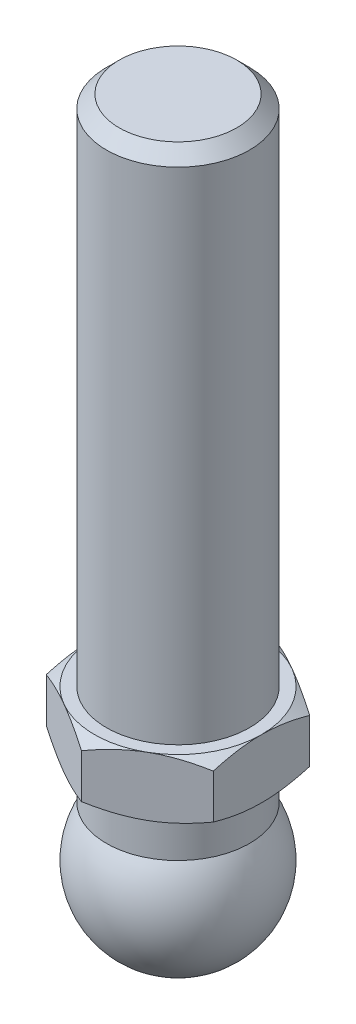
ISO-10303-21;
HEADER;
FILE_DESCRIPTION(('STEP AP214'),'2;1');
FILE_NAME('part.step','',(''),(''),'','','');
FILE_SCHEMA(('AUTOMOTIVE_DESIGN { 1 0 10303 214 1 1 1 1 }'));
ENDSEC;
DATA;
#1=APPLICATION_CONTEXT('core data for automotive mechanical design processes');
#2=APPLICATION_PROTOCOL_DEFINITION('international standard','automotive_design',2000,#1);
#3=PRODUCT_CONTEXT('',#1,'mechanical');
#4=PRODUCT('Part','Part','',(#3));
#5=PRODUCT_RELATED_PRODUCT_CATEGORY('part','',(#4));
#6=PRODUCT_DEFINITION_FORMATION('','',#4);
#7=PRODUCT_DEFINITION_CONTEXT('part definition',#1,'design');
#8=PRODUCT_DEFINITION('design','',#6,#7);
#9=PRODUCT_DEFINITION_SHAPE('','',#8);
#10=(LENGTH_UNIT() NAMED_UNIT(*) SI_UNIT(.MILLI.,.METRE.));
#11=(NAMED_UNIT(*) PLANE_ANGLE_UNIT() SI_UNIT($,.RADIAN.));
#12=(NAMED_UNIT(*) SI_UNIT($,.STERADIAN.) SOLID_ANGLE_UNIT());
#13=UNCERTAINTY_MEASURE_WITH_UNIT(LENGTH_MEASURE(1.E-05),#10,'distance_accuracy_value','');
#14=(GEOMETRIC_REPRESENTATION_CONTEXT(3) GLOBAL_UNCERTAINTY_ASSIGNED_CONTEXT((#13)) GLOBAL_UNIT_ASSIGNED_CONTEXT((#10,
#11,#12)) REPRESENTATION_CONTEXT('',''));
#15=CARTESIAN_POINT('',(0.,0.,0.));
#16=DIRECTION('',(0.,0.,1.));
#17=DIRECTION('',(1.,0.,0.));
#18=AXIS2_PLACEMENT_3D('',#15,#16,#17);
#19=CARTESIAN_POINT('',(0.,12.6,0.));
#20=DIRECTION('',(0.,-1.,0.));
#21=DIRECTION('',(0.,0.,-1.));
#22=AXIS2_PLACEMENT_3D('',#19,#20,#21);
#23=CONICAL_SURFACE('',#22,7.,1.0471975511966);
#24=CARTESIAN_POINT('',(-7.,8.53828268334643,12.1648696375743));
#25=CARTESIAN_POINT('',(-7.,8.68391573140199,11.8738003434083));
#26=CARTESIAN_POINT('',(-7.,8.82854589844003,11.5822239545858));
#27=CARTESIAN_POINT('',(-7.,9.11531569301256,10.997825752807));
#28=CARTESIAN_POINT('',(-7.,9.25745515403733,10.7050038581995));
#29=CARTESIAN_POINT('',(-7.,9.53902214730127,10.117331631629));
#30=CARTESIAN_POINT('',(-7.,9.67844364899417,9.8224784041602));
#31=CARTESIAN_POINT('',(-7.,9.95360604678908,9.23106328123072));
#32=CARTESIAN_POINT('',(-7.,10.0893470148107,8.93450141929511));
#33=CARTESIAN_POINT('',(-7.,10.3623110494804,8.32593520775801));
#34=CARTESIAN_POINT('',(-7.,10.4993254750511,8.0138369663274));
#35=CARTESIAN_POINT('',(-7.,10.7671383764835,7.38695797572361));
#36=CARTESIAN_POINT('',(-7.,10.8979365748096,7.07217710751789));
#37=CARTESIAN_POINT('',(-7.,11.1515530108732,6.43962449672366));
#38=CARTESIAN_POINT('',(-7.,11.274376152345,6.12185473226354));
#39=CARTESIAN_POINT('',(-7.,11.5099016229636,5.4826031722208));
#40=CARTESIAN_POINT('',(-7.,11.6226050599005,5.16112178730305));
#41=CARTESIAN_POINT('',(-7.,11.8599014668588,4.43821731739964));
#42=CARTESIAN_POINT('',(-7.,11.981118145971,4.03566892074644));
#43=CARTESIAN_POINT('',(-7.,12.1969740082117,3.22331060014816));
#44=CARTESIAN_POINT('',(-7.,12.2916155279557,2.81350131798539));
#45=CARTESIAN_POINT('',(-7.,12.4069999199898,2.1974256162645));
#46=CARTESIAN_POINT('',(-7.,12.4408518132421,1.99359214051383));
#47=CARTESIAN_POINT('',(-7.,12.4993191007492,1.58461613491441));
#48=CARTESIAN_POINT('',(-7.,12.5239358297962,1.37947379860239));
#49=CARTESIAN_POINT('',(-7.,12.5631968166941,0.968289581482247));
#50=CARTESIAN_POINT('',(-7.,12.5778439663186,0.762247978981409));
#51=CARTESIAN_POINT('',(-7.,12.5967021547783,0.349683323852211));
#52=CARTESIAN_POINT('',(-7.,12.6009132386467,0.143160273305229));
#53=CARTESIAN_POINT('',(-7.,12.5987493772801,-0.271082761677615));
#54=CARTESIAN_POINT('',(-7.,12.5923100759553,-0.47880240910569));
#55=CARTESIAN_POINT('',(-7.,12.5689433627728,-0.893645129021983));
#56=CARTESIAN_POINT('',(-7.,12.5520159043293,-1.10076819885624));
#57=CARTESIAN_POINT('',(-7.,12.5082124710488,-1.5140304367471));
#58=CARTESIAN_POINT('',(-7.,12.4813327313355,-1.72016920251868));
#59=CARTESIAN_POINT('',(-7.,12.4184180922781,-2.13103319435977));
#60=CARTESIAN_POINT('',(-7.,12.3823828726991,-2.33575837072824));
#61=CARTESIAN_POINT('',(-7.,12.2605686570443,-2.95437912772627));
#62=CARTESIAN_POINT('',(-7.,12.1618729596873,-3.36575077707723));
#63=CARTESIAN_POINT('',(-7.,11.9384533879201,-4.18138012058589));
#64=CARTESIAN_POINT('',(-7.,11.8137148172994,-4.58563365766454));
#65=CARTESIAN_POINT('',(-7.,11.5733248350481,-5.30320893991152));
#66=CARTESIAN_POINT('',(-7.,11.4612875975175,-5.6177595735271));
#67=CARTESIAN_POINT('',(-7.,11.2278514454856,-6.24325021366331));
#68=CARTESIAN_POINT('',(-7.,11.1064551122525,-6.55419118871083));
#69=CARTESIAN_POINT('',(-7.,10.8562070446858,-7.17328528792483));
#70=CARTESIAN_POINT('',(-7.,10.7273503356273,-7.48143638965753));
#71=CARTESIAN_POINT('',(-7.,10.4637823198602,-8.09523802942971));
#72=CARTESIAN_POINT('',(-7.,10.3290706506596,-8.40088841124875));
#73=CARTESIAN_POINT('',(-7.,10.0607840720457,-8.99716345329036));
#74=CARTESIAN_POINT('',(-7.,9.92740317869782,-9.2878756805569));
#75=CARTESIAN_POINT('',(-7.,9.65714715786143,-9.86766295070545));
#76=CARTESIAN_POINT('',(-7.,9.52027208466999,-10.1567380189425));
#77=CARTESIAN_POINT('',(-7.,9.24389786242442,-10.7329937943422));
#78=CARTESIAN_POINT('',(-7.,9.10440383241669,-11.0201769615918));
#79=CARTESIAN_POINT('',(-7.,8.82302286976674,-11.5933594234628));
#80=CARTESIAN_POINT('',(-7.,8.68113600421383,-11.879358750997));
#81=CARTESIAN_POINT('',(-7.,8.53828268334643,-12.1648696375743));
#82=B_SPLINE_CURVE_WITH_KNOTS('',3,(#24,#25,#26,#27,#28,#29,#30,#31,#32,#33,#34,#35,#36,#37,#38,
#39,#40,#41,#42,#43,#44,#45,#46,#47,#48,#49,#50,#51,#52,#53,#54,#55,#56,#57,#58,#59,#60,#61,#62,
#63,#64,#65,#66,#67,#68,#69,#70,#71,#72,#73,#74,#75,#76,#77,#78,#79,#80,#81),.UNSPECIFIED.,.F.,
.F.,(4,2,2,2,2,2,2,2,2,2,2,2,2,2,2,2,2,2,2,2,2,2,2,2,2,2,2,2,4),(0.,0.976413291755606,
1.95289161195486,2.93133423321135,3.90975772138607,4.93225217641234,5.95479223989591,
6.97669748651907,7.99849072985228,9.25906449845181,10.5195273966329,11.1392271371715,
11.7588372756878,12.3782676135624,12.9976952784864,13.6208795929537,14.2440666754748,
14.8674897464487,15.490934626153,16.7587972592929,18.027377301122,19.0289263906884,
20.0302002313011,21.0321496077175,22.0341611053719,22.9936838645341,23.9531917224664,
24.9109871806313,25.8687558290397),.UNSPECIFIED.);
#83=CARTESIAN_POINT('',(-7.,11.9747852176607,4.04145188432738));
#84=VERTEX_POINT('',#83);
#85=CARTESIAN_POINT('',(-7.,12.6,0.));
#86=VERTEX_POINT('',#85);
#87=EDGE_CURVE('E316',#84,#86,#82,.T.);
#88=ORIENTED_EDGE('',*,*,#87,.F.);
#89=CARTESIAN_POINT('',(0.0002,11.9747185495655,8.0830192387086));
#90=CARTESIAN_POINT('',(-0.153667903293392,12.0260001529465,7.99418356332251));
#91=CARTESIAN_POINT('',(-0.30810950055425,12.0749544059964,7.90501666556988));
#92=CARTESIAN_POINT('',(-0.618246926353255,12.1675672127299,7.72595873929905));
#93=CARTESIAN_POINT('',(-0.773943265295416,12.2112234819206,7.63606741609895));
#94=CARTESIAN_POINT('',(-1.24352516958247,12.3333884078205,7.36495417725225));
#95=CARTESIAN_POINT('',(-1.5592643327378,12.402874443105,7.18266208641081));
#96=CARTESIAN_POINT('',(-2.03176224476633,12.4843550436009,6.9098652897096));
#97=CARTESIAN_POINT('',(-2.18710922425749,12.5075665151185,6.82017566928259));
#98=CARTESIAN_POINT('',(-2.49850511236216,12.5464887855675,6.64039116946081));
#99=CARTESIAN_POINT('',(-2.65455395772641,12.5622002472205,6.55029632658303));
#100=CARTESIAN_POINT('',(-2.96692267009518,12.5857220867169,6.36995016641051));
#101=CARTESIAN_POINT('',(-3.12324202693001,12.5935414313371,6.27969914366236));
#102=CARTESIAN_POINT('',(-3.43601650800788,12.6011197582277,6.09911871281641));
#103=CARTESIAN_POINT('',(-3.59247162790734,12.600878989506,6.00878930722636));
#104=CARTESIAN_POINT('',(-4.02110687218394,12.5891402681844,5.76131663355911));
#105=CARTESIAN_POINT('',(-4.2931466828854,12.5694342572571,5.60425437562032));
#106=CARTESIAN_POINT('',(-4.8354194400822,12.5069465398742,5.29117305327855));
#107=CARTESIAN_POINT('',(-5.10565047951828,12.464143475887,5.13515508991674));
#108=CARTESIAN_POINT('',(-5.64901454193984,12.3571483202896,4.82144370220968));
#109=CARTESIAN_POINT('',(-5.92207900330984,12.2925029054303,4.66378986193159));
#110=CARTESIAN_POINT('',(-6.46413578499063,12.145783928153,4.35083323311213));
#111=CARTESIAN_POINT('',(-6.73313504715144,12.0637448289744,4.19552643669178));
#112=CARTESIAN_POINT('',(-7.0002,11.9747185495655,4.04133641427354));
#113=B_SPLINE_CURVE_WITH_KNOTS('',3,(#89,#90,#91,#92,#93,#94,#95,#96,#97,#98,#99,#100,#101,#102,
#103,#104,#105,#106,#107,#108,#109,#110,#111,#112),.UNSPECIFIED.,.F.,.F.,(4,2,2,2,2,2,2,2,2,2,2,
4),(0.,0.554727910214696,1.10969417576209,2.2219327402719,2.76443041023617,3.30688013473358,
3.8487128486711,4.3905288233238,5.33376515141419,6.27787517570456,7.2429241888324,
8.20607866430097),.UNSPECIFIED.);
#114=CARTESIAN_POINT('',(-3.5,12.6,6.06217782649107));
#115=VERTEX_POINT('',#114);
#116=EDGE_CURVE('E138',#115,#84,#113,.T.);
#117=ORIENTED_EDGE('',*,*,#116,.F.);
#118=CARTESIAN_POINT('',(0.,12.6,0.));
#119=DIRECTION('',(0.,-1.,0.));
#120=DIRECTION('',(0.,0.,-1.));
#121=AXIS2_PLACEMENT_3D('',#118,#119,#120);
#122=CIRCLE('',#121,7.);
#123=EDGE_CURVE('E286',#115,#86,#122,.T.);
#124=ORIENTED_EDGE('',*,*,#123,.T.);
#125=EDGE_LOOP('',(#88,#117,#124));
#126=FACE_BOUND('',#125,.T.);
#127=ADVANCED_FACE('F17',(#126),#23,.T.);
#128=CARTESIAN_POINT('',(-7.,11.9747852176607,-4.04145188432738));
#129=VERTEX_POINT('',#128);
#130=EDGE_CURVE('E196',#86,#129,#82,.T.);
#131=ORIENTED_EDGE('',*,*,#130,.F.);
#132=CARTESIAN_POINT('',(-3.5,12.6,-6.06217782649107));
#133=VERTEX_POINT('',#132);
#134=EDGE_CURVE('E198',#86,#133,#122,.T.);
#135=ORIENTED_EDGE('',*,*,#134,.T.);
#136=CARTESIAN_POINT('',(-7.0002,11.9747185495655,-4.04133641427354));
#137=CARTESIAN_POINT('',(-6.84633209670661,12.0260001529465,-4.13017208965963));
#138=CARTESIAN_POINT('',(-6.69189049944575,12.0749544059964,-4.21933898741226));
#139=CARTESIAN_POINT('',(-6.38175307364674,12.1675672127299,-4.39839691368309));
#140=CARTESIAN_POINT('',(-6.22605673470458,12.2112234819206,-4.48828823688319));
#141=CARTESIAN_POINT('',(-5.75647483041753,12.3333884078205,-4.75940147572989));
#142=CARTESIAN_POINT('',(-5.4407356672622,12.402874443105,-4.94169356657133));
#143=CARTESIAN_POINT('',(-4.96823775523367,12.4843550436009,-5.21449036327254));
#144=CARTESIAN_POINT('',(-4.81289077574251,12.5075665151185,-5.30417998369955));
#145=CARTESIAN_POINT('',(-4.50149488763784,12.5464887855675,-5.48396448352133));
#146=CARTESIAN_POINT('',(-4.34544604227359,12.5622002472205,-5.57405932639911));
#147=CARTESIAN_POINT('',(-4.03307732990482,12.5857220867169,-5.75440548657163));
#148=CARTESIAN_POINT('',(-3.87675797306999,12.5935414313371,-5.84465650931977));
#149=CARTESIAN_POINT('',(-3.56398349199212,12.6011197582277,-6.02523694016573));
#150=CARTESIAN_POINT('',(-3.40752837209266,12.600878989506,-6.11556634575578));
#151=CARTESIAN_POINT('',(-2.97889312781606,12.5891402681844,-6.36303901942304));
#152=CARTESIAN_POINT('',(-2.7068533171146,12.5694342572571,-6.52010127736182));
#153=CARTESIAN_POINT('',(-2.1645805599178,12.5069465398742,-6.83318259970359));
#154=CARTESIAN_POINT('',(-1.89434952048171,12.464143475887,-6.9892005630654));
#155=CARTESIAN_POINT('',(-1.35098545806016,12.3571483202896,-7.30291195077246));
#156=CARTESIAN_POINT('',(-1.07792099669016,12.2925029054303,-7.46056579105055));
#157=CARTESIAN_POINT('',(-0.535864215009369,12.145783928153,-7.77352241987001));
#158=CARTESIAN_POINT('',(-0.266864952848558,12.0637448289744,-7.92882921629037));
#159=CARTESIAN_POINT('',(0.000200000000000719,11.9747185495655,-8.0830192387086));
#160=B_SPLINE_CURVE_WITH_KNOTS('',3,(#136,#137,#138,#139,#140,#141,#142,#143,#144,#145,#146,
#147,#148,#149,#150,#151,#152,#153,#154,#155,#156,#157,#158,#159),.UNSPECIFIED.,.F.,.F.,(4,2,2,
2,2,2,2,2,2,2,2,4),(0.,0.554727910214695,1.10969417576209,2.2219327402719,2.76443041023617,
3.30688013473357,3.8487128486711,4.39052882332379,5.33376515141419,6.27787517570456,
7.2429241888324,8.20607866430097),.UNSPECIFIED.);
#161=EDGE_CURVE('E186',#129,#133,#160,.T.);
#162=ORIENTED_EDGE('',*,*,#161,.F.);
#163=EDGE_LOOP('',(#131,#135,#162));
#164=FACE_BOUND('',#163,.T.);
#165=ADVANCED_FACE('F195',(#164),#23,.T.);
#166=CARTESIAN_POINT('',(0.,11.9747852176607,-8.08290376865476));
#167=VERTEX_POINT('',#166);
#168=EDGE_CURVE('E200',#133,#167,#160,.T.);
#169=ORIENTED_EDGE('',*,*,#168,.F.);
#170=CARTESIAN_POINT('',(3.5,12.6,-6.06217782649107));
#171=VERTEX_POINT('',#170);
#172=EDGE_CURVE('E296',#133,#171,#122,.T.);
#173=ORIENTED_EDGE('',*,*,#172,.T.);
#174=CARTESIAN_POINT('',(-0.0002,11.9747185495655,-8.0830192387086));
#175=CARTESIAN_POINT('',(0.153667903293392,12.0260001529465,-7.99418356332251));
#176=CARTESIAN_POINT('',(0.30810950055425,12.0749544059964,-7.90501666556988));
#177=CARTESIAN_POINT('',(0.618246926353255,12.1675672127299,-7.72595873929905));
#178=CARTESIAN_POINT('',(0.773943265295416,12.2112234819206,-7.63606741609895));
#179=CARTESIAN_POINT('',(1.24352516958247,12.3333884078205,-7.36495417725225));
#180=CARTESIAN_POINT('',(1.5592643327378,12.402874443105,-7.18266208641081));
#181=CARTESIAN_POINT('',(2.03176224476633,12.4843550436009,-6.9098652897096));
#182=CARTESIAN_POINT('',(2.18710922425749,12.5075665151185,-6.82017566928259));
#183=CARTESIAN_POINT('',(2.49850511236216,12.5464887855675,-6.64039116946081));
#184=CARTESIAN_POINT('',(2.65455395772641,12.5622002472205,-6.55029632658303));
#185=CARTESIAN_POINT('',(2.96692267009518,12.5857220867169,-6.36995016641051));
#186=CARTESIAN_POINT('',(3.12324202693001,12.5935414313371,-6.27969914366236));
#187=CARTESIAN_POINT('',(3.43601650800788,12.6011197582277,-6.09911871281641));
#188=CARTESIAN_POINT('',(3.59247162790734,12.600878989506,-6.00878930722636));
#189=CARTESIAN_POINT('',(4.02110687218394,12.5891402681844,-5.76131663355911));
#190=CARTESIAN_POINT('',(4.2931466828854,12.5694342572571,-5.60425437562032));
#191=CARTESIAN_POINT('',(4.8354194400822,12.5069465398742,-5.29117305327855));
#192=CARTESIAN_POINT('',(5.10565047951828,12.464143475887,-5.13515508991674));
#193=CARTESIAN_POINT('',(5.64901454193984,12.3571483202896,-4.82144370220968));
#194=CARTESIAN_POINT('',(5.92207900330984,12.2925029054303,-4.66378986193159));
#195=CARTESIAN_POINT('',(6.46413578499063,12.145783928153,-4.35083323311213));
#196=CARTESIAN_POINT('',(6.73313504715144,12.0637448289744,-4.19552643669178));
#197=CARTESIAN_POINT('',(7.0002,11.9747185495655,-4.04133641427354));
#198=B_SPLINE_CURVE_WITH_KNOTS('',3,(#174,#175,#176,#177,#178,#179,#180,#181,#182,#183,#184,
#185,#186,#187,#188,#189,#190,#191,#192,#193,#194,#195,#196,#197),.UNSPECIFIED.,.F.,.F.,(4,2,2,
2,2,2,2,2,2,2,2,4),(0.,0.554727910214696,1.10969417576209,2.2219327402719,2.76443041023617,
3.30688013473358,3.8487128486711,4.3905288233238,5.33376515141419,6.27787517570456,
7.2429241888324,8.20607866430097),.UNSPECIFIED.);
#199=EDGE_CURVE('E246',#167,#171,#198,.T.);
#200=ORIENTED_EDGE('',*,*,#199,.F.);
#201=EDGE_LOOP('',(#169,#173,#200));
#202=FACE_BOUND('',#201,.T.);
#203=ADVANCED_FACE('F349',(#202),#23,.T.);
#204=CARTESIAN_POINT('',(7.,11.9747852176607,-4.04145188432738));
#205=VERTEX_POINT('',#204);
#206=EDGE_CURVE('E241',#171,#205,#198,.T.);
#207=ORIENTED_EDGE('',*,*,#206,.F.);
#208=CARTESIAN_POINT('',(7.,12.6,0.));
#209=VERTEX_POINT('',#208);
#210=EDGE_CURVE('E291',#171,#209,#122,.T.);
#211=ORIENTED_EDGE('',*,*,#210,.T.);
#212=CARTESIAN_POINT('',(7.,8.53828268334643,-12.1648696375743));
#213=CARTESIAN_POINT('',(7.,8.68391573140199,-11.8738003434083));
#214=CARTESIAN_POINT('',(7.,8.82854589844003,-11.5822239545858));
#215=CARTESIAN_POINT('',(7.,9.11531569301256,-10.997825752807));
#216=CARTESIAN_POINT('',(7.,9.25745515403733,-10.7050038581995));
#217=CARTESIAN_POINT('',(7.,9.53902214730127,-10.117331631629));
#218=CARTESIAN_POINT('',(7.,9.67844364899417,-9.8224784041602));
#219=CARTESIAN_POINT('',(7.,9.95360604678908,-9.23106328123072));
#220=CARTESIAN_POINT('',(7.,10.0893470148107,-8.93450141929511));
#221=CARTESIAN_POINT('',(7.,10.3623110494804,-8.32593520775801));
#222=CARTESIAN_POINT('',(7.,10.4993254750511,-8.0138369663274));
#223=CARTESIAN_POINT('',(7.,10.7671383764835,-7.38695797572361));
#224=CARTESIAN_POINT('',(7.,10.8979365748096,-7.07217710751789));
#225=CARTESIAN_POINT('',(7.,11.1515530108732,-6.43962449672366));
#226=CARTESIAN_POINT('',(7.,11.274376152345,-6.12185473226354));
#227=CARTESIAN_POINT('',(7.,11.5099016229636,-5.4826031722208));
#228=CARTESIAN_POINT('',(7.,11.6226050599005,-5.16112178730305));
#229=CARTESIAN_POINT('',(7.,11.8599014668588,-4.43821731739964));
#230=CARTESIAN_POINT('',(7.,11.981118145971,-4.03566892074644));
#231=CARTESIAN_POINT('',(7.,12.1969740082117,-3.22331060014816));
#232=CARTESIAN_POINT('',(7.,12.2916155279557,-2.81350131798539));
#233=CARTESIAN_POINT('',(7.,12.4069999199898,-2.1974256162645));
#234=CARTESIAN_POINT('',(7.,12.4408518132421,-1.99359214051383));
#235=CARTESIAN_POINT('',(7.,12.4993191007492,-1.58461613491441));
#236=CARTESIAN_POINT('',(7.,12.5239358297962,-1.37947379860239));
#237=CARTESIAN_POINT('',(7.,12.5631968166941,-0.968289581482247));
#238=CARTESIAN_POINT('',(7.,12.5778439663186,-0.762247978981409));
#239=CARTESIAN_POINT('',(7.,12.5967021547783,-0.349683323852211));
#240=CARTESIAN_POINT('',(7.,12.6009132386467,-0.143160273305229));
#241=CARTESIAN_POINT('',(7.,12.5987493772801,0.271082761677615));
#242=CARTESIAN_POINT('',(7.,12.5923100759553,0.47880240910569));
#243=CARTESIAN_POINT('',(7.,12.5689433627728,0.893645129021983));
#244=CARTESIAN_POINT('',(7.,12.5520159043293,1.10076819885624));
#245=CARTESIAN_POINT('',(7.,12.5082124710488,1.5140304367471));
#246=CARTESIAN_POINT('',(7.,12.4813327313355,1.72016920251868));
#247=CARTESIAN_POINT('',(7.,12.4184180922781,2.13103319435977));
#248=CARTESIAN_POINT('',(7.,12.3823828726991,2.33575837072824));
#249=CARTESIAN_POINT('',(7.,12.2605686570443,2.95437912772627));
#250=CARTESIAN_POINT('',(7.,12.1618729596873,3.36575077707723));
#251=CARTESIAN_POINT('',(7.,11.9384533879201,4.18138012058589));
#252=CARTESIAN_POINT('',(7.,11.8137148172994,4.58563365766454));
#253=CARTESIAN_POINT('',(7.,11.5733248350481,5.30320893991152));
#254=CARTESIAN_POINT('',(7.,11.4612875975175,5.6177595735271));
#255=CARTESIAN_POINT('',(7.,11.2278514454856,6.24325021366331));
#256=CARTESIAN_POINT('',(7.,11.1064551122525,6.55419118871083));
#257=CARTESIAN_POINT('',(7.,10.8562070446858,7.17328528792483));
#258=CARTESIAN_POINT('',(7.,10.7273503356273,7.48143638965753));
#259=CARTESIAN_POINT('',(7.,10.4637823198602,8.09523802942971));
#260=CARTESIAN_POINT('',(7.,10.3290706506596,8.40088841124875));
#261=CARTESIAN_POINT('',(7.,10.0607840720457,8.99716345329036));
#262=CARTESIAN_POINT('',(7.,9.92740317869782,9.2878756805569));
#263=CARTESIAN_POINT('',(7.,9.65714715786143,9.86766295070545));
#264=CARTESIAN_POINT('',(7.,9.52027208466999,10.1567380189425));
#265=CARTESIAN_POINT('',(7.,9.24389786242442,10.7329937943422));
#266=CARTESIAN_POINT('',(7.,9.10440383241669,11.0201769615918));
#267=CARTESIAN_POINT('',(7.,8.82302286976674,11.5933594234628));
#268=CARTESIAN_POINT('',(7.,8.68113600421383,11.879358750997));
#269=CARTESIAN_POINT('',(7.,8.53828268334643,12.1648696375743));
#270=B_SPLINE_CURVE_WITH_KNOTS('',3,(#212,#213,#214,#215,#216,#217,#218,#219,#220,#221,#222,
#223,#224,#225,#226,#227,#228,#229,#230,#231,#232,#233,#234,#235,#236,#237,#238,#239,#240,#241,
#242,#243,#244,#245,#246,#247,#248,#249,#250,#251,#252,#253,#254,#255,#256,#257,#258,#259,#260,
#261,#262,#263,#264,#265,#266,#267,#268,#269),.UNSPECIFIED.,.F.,.F.,(4,2,2,2,2,2,2,2,2,2,2,2,2,
2,2,2,2,2,2,2,2,2,2,2,2,2,2,2,4),(0.,0.976413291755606,1.95289161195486,2.93133423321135,
3.90975772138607,4.93225217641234,5.95479223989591,6.97669748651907,7.99849072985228,
9.25906449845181,10.5195273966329,11.1392271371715,11.7588372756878,12.3782676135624,
12.9976952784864,13.6208795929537,14.2440666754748,14.8674897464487,15.490934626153,
16.7587972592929,18.027377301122,19.0289263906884,20.0302002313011,21.0321496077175,
22.0341611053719,22.9936838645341,23.9531917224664,24.9109871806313,25.8687558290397),.UNSPECIFIED.);
#271=EDGE_CURVE('E252',#205,#209,#270,.T.);
#272=ORIENTED_EDGE('',*,*,#271,.F.);
#273=EDGE_LOOP('',(#207,#211,#272));
#274=FACE_BOUND('',#273,.T.);
#275=ADVANCED_FACE('F359',(#274),#23,.T.);
#276=CARTESIAN_POINT('',(7.,11.9747852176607,4.04145188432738));
#277=VERTEX_POINT('',#276);
#278=EDGE_CURVE('E254',#209,#277,#270,.T.);
#279=ORIENTED_EDGE('',*,*,#278,.F.);
#280=CARTESIAN_POINT('',(3.5,12.6,6.06217782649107));
#281=VERTEX_POINT('',#280);
#282=EDGE_CURVE('E284',#209,#281,#122,.T.);
#283=ORIENTED_EDGE('',*,*,#282,.T.);
#284=CARTESIAN_POINT('',(7.0002,11.9747185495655,4.04133641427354));
#285=CARTESIAN_POINT('',(6.84633209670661,12.0260001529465,4.13017208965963));
#286=CARTESIAN_POINT('',(6.69189049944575,12.0749544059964,4.21933898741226));
#287=CARTESIAN_POINT('',(6.38175307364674,12.1675672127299,4.39839691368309));
#288=CARTESIAN_POINT('',(6.22605673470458,12.2112234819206,4.48828823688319));
#289=CARTESIAN_POINT('',(5.75647483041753,12.3333884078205,4.75940147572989));
#290=CARTESIAN_POINT('',(5.4407356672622,12.402874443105,4.94169356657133));
#291=CARTESIAN_POINT('',(4.96823775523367,12.4843550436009,5.21449036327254));
#292=CARTESIAN_POINT('',(4.81289077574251,12.5075665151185,5.30417998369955));
#293=CARTESIAN_POINT('',(4.50149488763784,12.5464887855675,5.48396448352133));
#294=CARTESIAN_POINT('',(4.34544604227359,12.5622002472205,5.57405932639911));
#295=CARTESIAN_POINT('',(4.03307732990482,12.5857220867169,5.75440548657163));
#296=CARTESIAN_POINT('',(3.87675797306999,12.5935414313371,5.84465650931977));
#297=CARTESIAN_POINT('',(3.56398349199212,12.6011197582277,6.02523694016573));
#298=CARTESIAN_POINT('',(3.40752837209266,12.600878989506,6.11556634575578));
#299=CARTESIAN_POINT('',(2.97889312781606,12.5891402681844,6.36303901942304));
#300=CARTESIAN_POINT('',(2.7068533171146,12.5694342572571,6.52010127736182));
#301=CARTESIAN_POINT('',(2.1645805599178,12.5069465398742,6.83318259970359));
#302=CARTESIAN_POINT('',(1.89434952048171,12.464143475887,6.9892005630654));
#303=CARTESIAN_POINT('',(1.35098545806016,12.3571483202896,7.30291195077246));
#304=CARTESIAN_POINT('',(1.07792099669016,12.2925029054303,7.46056579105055));
#305=CARTESIAN_POINT('',(0.535864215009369,12.145783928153,7.77352241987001));
#306=CARTESIAN_POINT('',(0.266864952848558,12.0637448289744,7.92882921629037));
#307=CARTESIAN_POINT('',(-0.000200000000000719,11.9747185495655,8.0830192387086));
#308=B_SPLINE_CURVE_WITH_KNOTS('',3,(#284,#285,#286,#287,#288,#289,#290,#291,#292,#293,#294,
#295,#296,#297,#298,#299,#300,#301,#302,#303,#304,#305,#306,#307),.UNSPECIFIED.,.F.,.F.,(4,2,2,
2,2,2,2,2,2,2,2,4),(0.,0.554727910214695,1.10969417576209,2.2219327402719,2.76443041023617,
3.30688013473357,3.8487128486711,4.39052882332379,5.33376515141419,6.27787517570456,
7.2429241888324,8.20607866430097),.UNSPECIFIED.);
#309=EDGE_CURVE('E129',#277,#281,#308,.T.);
#310=ORIENTED_EDGE('',*,*,#309,.F.);
#311=EDGE_LOOP('',(#279,#283,#310));
#312=FACE_BOUND('',#311,.T.);
#313=ADVANCED_FACE('F288',(#312),#23,.T.);
#314=CARTESIAN_POINT('',(0.,11.9747852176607,8.08290376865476));
#315=VERTEX_POINT('',#314);
#316=EDGE_CURVE('E119',#281,#315,#308,.T.);
#317=ORIENTED_EDGE('',*,*,#316,.F.);
#318=EDGE_CURVE('E277',#281,#115,#122,.T.);
#319=ORIENTED_EDGE('',*,*,#318,.T.);
#320=EDGE_CURVE('E32',#315,#115,#113,.T.);
#321=ORIENTED_EDGE('',*,*,#320,.F.);
#322=EDGE_LOOP('',(#317,#319,#321));
#323=FACE_BOUND('',#322,.T.);
#324=ADVANCED_FACE('F276',(#323),#23,.T.);
#325=CARTESIAN_POINT('',(0.,55.6,0.));
#326=DIRECTION('',(0.,-1.,0.));
#327=DIRECTION('',(0.,0.,-1.));
#328=AXIS2_PLACEMENT_3D('',#325,#326,#327);
#329=PLANE('',#328);
#330=CARTESIAN_POINT('',(0.,55.6,0.));
#331=DIRECTION('',(0.,-1.,0.));
#332=DIRECTION('',(0.,0.,-1.));
#333=AXIS2_PLACEMENT_3D('',#330,#331,#332);
#334=CIRCLE('',#333,4.9265);
#335=CARTESIAN_POINT('',(0.,55.6,-4.9265));
#336=VERTEX_POINT('',#335);
#337=EDGE_CURVE('E25',#336,#336,#334,.T.);
#338=ORIENTED_EDGE('',*,*,#337,.F.);
#339=EDGE_LOOP('',(#338));
#340=FACE_BOUND('',#339,.T.);
#341=ADVANCED_FACE('F19',(#340),#329,.F.);
#342=CARTESIAN_POINT('',(0.,55.6,0.));
#343=DIRECTION('',(0.,-1.,0.));
#344=DIRECTION('',(0.,0.,-1.));
#345=AXIS2_PLACEMENT_3D('',#342,#343,#344);
#346=CONICAL_SURFACE('',#345,4.9265,0.785398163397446);
#347=CARTESIAN_POINT('',(0.,54.5265,0.));
#348=DIRECTION('',(0.,-1.,0.));
#349=DIRECTION('',(0.,0.,-1.));
#350=AXIS2_PLACEMENT_3D('',#347,#348,#349);
#351=CIRCLE('',#350,6.);
#352=CARTESIAN_POINT('',(0.,54.5265,-6.));
#353=VERTEX_POINT('',#352);
#354=EDGE_CURVE('E293',#353,#353,#351,.T.);
#355=ORIENTED_EDGE('',*,*,#354,.F.);
#356=EDGE_LOOP('',(#355));
#357=FACE_BOUND('',#356,.T.);
#358=ORIENTED_EDGE('',*,*,#337,.T.);
#359=EDGE_LOOP('',(#358));
#360=FACE_BOUND('',#359,.T.);
#361=ADVANCED_FACE('F357',(#357,#360),#346,.T.);
#362=CARTESIAN_POINT('',(0.,-7.,0.));
#363=DIRECTION('',(0.,-1.,0.));
#364=DIRECTION('',(0.,0.,-1.));
#365=AXIS2_PLACEMENT_3D('',#362,#363,#364);
#366=CYLINDRICAL_SURFACE('',#365,6.);
#367=CARTESIAN_POINT('',(0.,12.6,0.));
#368=DIRECTION('',(0.,-1.,0.));
#369=DIRECTION('',(0.,0.,-1.));
#370=AXIS2_PLACEMENT_3D('',#367,#368,#369);
#371=CIRCLE('',#370,6.);
#372=CARTESIAN_POINT('',(0.,12.6,-6.));
#373=VERTEX_POINT('',#372);
#374=EDGE_CURVE('E290',#373,#373,#371,.T.);
#375=ORIENTED_EDGE('',*,*,#374,.F.);
#376=EDGE_LOOP('',(#375));
#377=FACE_BOUND('',#376,.T.);
#378=ORIENTED_EDGE('',*,*,#354,.T.);
#379=EDGE_LOOP('',(#378));
#380=FACE_BOUND('',#379,.T.);
#381=ADVANCED_FACE('F442',(#377,#380),#366,.T.);
#382=CARTESIAN_POINT('',(6.,12.6,0.));
#383=DIRECTION('',(0.,-1.,0.));
#384=DIRECTION('',(0.,0.,-1.));
#385=AXIS2_PLACEMENT_3D('',#382,#383,#384);
#386=PLANE('',#385);
#387=ORIENTED_EDGE('',*,*,#282,.F.);
#388=ORIENTED_EDGE('',*,*,#210,.F.);
#389=ORIENTED_EDGE('',*,*,#172,.F.);
#390=ORIENTED_EDGE('',*,*,#134,.F.);
#391=ORIENTED_EDGE('',*,*,#123,.F.);
#392=ORIENTED_EDGE('',*,*,#318,.F.);
#393=EDGE_LOOP('',(#387,#388,#389,#390,#391,#392));
#394=FACE_BOUND('',#393,.T.);
#395=ORIENTED_EDGE('',*,*,#374,.T.);
#396=EDGE_LOOP('',(#395));
#397=FACE_BOUND('',#396,.T.);
#398=ADVANCED_FACE('F281',(#394,#397),#386,.F.);
#399=CARTESIAN_POINT('',(-7.,7.65,-4.04145188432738));
#400=DIRECTION('',(-1.,0.,0.));
#401=DIRECTION('',(0.,0.,1.));
#402=AXIS2_PLACEMENT_3D('',#399,#400,#401);
#403=PLANE('',#402);
#404=ORIENTED_EDGE('',*,*,#87,.T.);
#405=ORIENTED_EDGE('',*,*,#130,.T.);
#406=DIRECTION('',(0.,1.,0.));
#407=VECTOR('',#406,1.);
#408=CARTESIAN_POINT('',(-7.,7.65,-4.04145188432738));
#409=LINE('',#408,#407);
#410=CARTESIAN_POINT('',(-7.,8.27521478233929,-4.04145188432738));
#411=VERTEX_POINT('',#410);
#412=EDGE_CURVE('E112',#411,#129,#409,.T.);
#413=ORIENTED_EDGE('',*,*,#412,.F.);
#414=CARTESIAN_POINT('',(-7.,11.7117173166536,-12.1648696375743));
#415=CARTESIAN_POINT('',(-7.,11.566084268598,-11.8738003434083));
#416=CARTESIAN_POINT('',(-7.,11.42145410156,-11.5822239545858));
#417=CARTESIAN_POINT('',(-7.,11.1346843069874,-10.997825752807));
#418=CARTESIAN_POINT('',(-7.,10.9925448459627,-10.7050038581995));
#419=CARTESIAN_POINT('',(-7.,10.7109778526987,-10.1173316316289));
#420=CARTESIAN_POINT('',(-7.,10.5715563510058,-9.82247840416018));
#421=CARTESIAN_POINT('',(-7.,10.2963939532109,-9.2310632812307));
#422=CARTESIAN_POINT('',(-7.,10.1606529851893,-8.93450141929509));
#423=CARTESIAN_POINT('',(-7.,9.88768895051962,-8.32593520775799));
#424=CARTESIAN_POINT('',(-7.,9.75067452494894,-8.01383696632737));
#425=CARTESIAN_POINT('',(-7.,9.48286162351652,-7.38695797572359));
#426=CARTESIAN_POINT('',(-7.,9.3520634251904,-7.07217710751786));
#427=CARTESIAN_POINT('',(-7.,9.09844698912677,-6.43962449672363));
#428=CARTESIAN_POINT('',(-7.,8.97562384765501,-6.12185473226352));
#429=CARTESIAN_POINT('',(-7.,8.7400983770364,-5.48260317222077));
#430=CARTESIAN_POINT('',(-7.,8.62739494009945,-5.16112178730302));
#431=CARTESIAN_POINT('',(-7.,8.39009853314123,-4.43821731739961));
#432=CARTESIAN_POINT('',(-7.,8.26888185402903,-4.0356689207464));
#433=CARTESIAN_POINT('',(-7.,8.05302599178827,-3.22331060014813));
#434=CARTESIAN_POINT('',(-7.,7.95838447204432,-2.81350131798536));
#435=CARTESIAN_POINT('',(-7.,7.84300008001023,-2.19742561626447));
#436=CARTESIAN_POINT('',(-7.,7.80914818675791,-1.9935921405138));
#437=CARTESIAN_POINT('',(-7.,7.75068089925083,-1.58461613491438));
#438=CARTESIAN_POINT('',(-7.,7.7260641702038,-1.37947379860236));
#439=CARTESIAN_POINT('',(-7.,7.68680318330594,-0.968289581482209));
#440=CARTESIAN_POINT('',(-7.,7.67215603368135,-0.762247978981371));
#441=CARTESIAN_POINT('',(-7.,7.65329784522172,-0.349683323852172));
#442=CARTESIAN_POINT('',(-7.,7.64908676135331,-0.14316027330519));
#443=CARTESIAN_POINT('',(-7.,7.65125062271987,0.271082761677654));
#444=CARTESIAN_POINT('',(-7.,7.65768992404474,0.478802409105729));
#445=CARTESIAN_POINT('',(-7.,7.68105663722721,0.893645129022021));
#446=CARTESIAN_POINT('',(-7.,7.69798409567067,1.10076819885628));
#447=CARTESIAN_POINT('',(-7.,7.74178752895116,1.51403043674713));
#448=CARTESIAN_POINT('',(-7.,7.76866726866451,1.72016920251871));
#449=CARTESIAN_POINT('',(-7.,7.83158190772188,2.13103319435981));
#450=CARTESIAN_POINT('',(-7.,7.86761712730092,2.33575837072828));
#451=CARTESIAN_POINT('',(-7.,7.98943134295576,2.95437912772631));
#452=CARTESIAN_POINT('',(-7.,8.08812704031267,3.36575077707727));
#453=CARTESIAN_POINT('',(-7.,8.31154661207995,4.18138012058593));
#454=CARTESIAN_POINT('',(-7.,8.43628518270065,4.58563365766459));
#455=CARTESIAN_POINT('',(-7.,8.67667516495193,5.30320893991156));
#456=CARTESIAN_POINT('',(-7.,8.78871240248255,5.61775957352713));
#457=CARTESIAN_POINT('',(-7.,9.02214855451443,6.24325021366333));
#458=CARTESIAN_POINT('',(-7.,9.14354488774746,6.55419118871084));
#459=CARTESIAN_POINT('',(-7.,9.39379295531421,7.17328528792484));
#460=CARTESIAN_POINT('',(-7.,9.52264966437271,7.48143638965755));
#461=CARTESIAN_POINT('',(-7.,9.78621768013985,8.09523802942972));
#462=CARTESIAN_POINT('',(-7.,9.92092934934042,8.40088841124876));
#463=CARTESIAN_POINT('',(-7.,10.1892159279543,8.99716345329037));
#464=CARTESIAN_POINT('',(-7.,10.3225968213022,9.28787568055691));
#465=CARTESIAN_POINT('',(-7.,10.5928528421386,9.86766295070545));
#466=CARTESIAN_POINT('',(-7.,10.72972791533,10.1567380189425));
#467=CARTESIAN_POINT('',(-7.,11.0061021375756,10.7329937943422));
#468=CARTESIAN_POINT('',(-7.,11.1455961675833,11.0201769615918));
#469=CARTESIAN_POINT('',(-7.,11.4269771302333,11.5933594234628));
#470=CARTESIAN_POINT('',(-7.,11.5688639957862,11.879358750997));
#471=CARTESIAN_POINT('',(-7.,11.7117173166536,12.1648696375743));
#472=B_SPLINE_CURVE_WITH_KNOTS('',3,(#414,#415,#416,#417,#418,#419,#420,#421,#422,#423,#424,
#425,#426,#427,#428,#429,#430,#431,#432,#433,#434,#435,#436,#437,#438,#439,#440,#441,#442,#443,
#444,#445,#446,#447,#448,#449,#450,#451,#452,#453,#454,#455,#456,#457,#458,#459,#460,#461,#462,
#463,#464,#465,#466,#467,#468,#469,#470,#471),.UNSPECIFIED.,.F.,.F.,(4,2,2,2,2,2,2,2,2,2,2,2,2,
2,2,2,2,2,2,2,2,2,2,2,2,2,2,2,4),(0.,0.976413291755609,1.95289161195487,2.93133423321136,
3.90975772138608,4.93225217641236,5.95479223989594,6.9766974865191,7.99849072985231,
9.25906449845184,10.5195273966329,11.1392271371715,11.7588372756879,12.3782676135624,
12.9976952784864,13.6208795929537,14.2440666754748,14.8674897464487,15.490934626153,
16.758797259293,18.027377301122,19.0289263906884,20.0302002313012,21.0321496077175,
22.0341611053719,22.9936838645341,23.9531917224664,24.9109871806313,25.8687558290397),.UNSPECIFIED.);
#473=CARTESIAN_POINT('',(-7.,7.65,0.));
#474=VERTEX_POINT('',#473);
#475=EDGE_CURVE('E202',#411,#474,#472,.T.);
#476=ORIENTED_EDGE('',*,*,#475,.T.);
#477=CARTESIAN_POINT('',(-7.,8.27521478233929,4.04145188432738));
#478=VERTEX_POINT('',#477);
#479=EDGE_CURVE('E199',#474,#478,#472,.T.);
#480=ORIENTED_EDGE('',*,*,#479,.T.);
#481=DIRECTION('',(0.,1.,0.));
#482=VECTOR('',#481,1.);
#483=CARTESIAN_POINT('',(-7.,7.65,4.04145188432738));
#484=LINE('',#483,#482);
#485=EDGE_CURVE('E121',#478,#84,#484,.T.);
#486=ORIENTED_EDGE('',*,*,#485,.T.);
#487=EDGE_LOOP('',(#404,#405,#413,#476,#480,#486));
#488=FACE_BOUND('',#487,.T.);
#489=ADVANCED_FACE('F227',(#488),#403,.T.);
#490=CARTESIAN_POINT('',(0.,7.65,-8.08290376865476));
#491=DIRECTION('',(-0.5,0.,-0.866025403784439));
#492=DIRECTION('',(-0.866025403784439,0.,0.5));
#493=AXIS2_PLACEMENT_3D('',#490,#491,#492);
#494=PLANE('',#493);
#495=ORIENTED_EDGE('',*,*,#161,.T.);
#496=ORIENTED_EDGE('',*,*,#168,.T.);
#497=DIRECTION('',(0.,1.,0.));
#498=VECTOR('',#497,1.);
#499=CARTESIAN_POINT('',(0.,7.65,-8.08290376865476));
#500=LINE('',#499,#498);
#501=CARTESIAN_POINT('',(0.,8.27521478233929,-8.08290376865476));
#502=VERTEX_POINT('',#501);
#503=EDGE_CURVE('E178',#502,#167,#500,.T.);
#504=ORIENTED_EDGE('',*,*,#503,.F.);
#505=CARTESIAN_POINT('',(0.0002,8.2752814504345,-8.0830192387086));
#506=CARTESIAN_POINT('',(-0.153667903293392,8.22399984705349,-7.99418356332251));
#507=CARTESIAN_POINT('',(-0.30810950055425,8.17504559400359,-7.90501666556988));
#508=CARTESIAN_POINT('',(-0.618246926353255,8.08243278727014,-7.72595873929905));
#509=CARTESIAN_POINT('',(-0.773943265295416,8.03877651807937,-7.63606741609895));
#510=CARTESIAN_POINT('',(-1.24352516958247,7.9166115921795,-7.36495417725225));
#511=CARTESIAN_POINT('',(-1.5592643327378,7.84712555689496,-7.18266208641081));
#512=CARTESIAN_POINT('',(-2.03176224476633,7.7656449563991,-6.9098652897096));
#513=CARTESIAN_POINT('',(-2.18710922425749,7.74243348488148,-6.82017566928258));
#514=CARTESIAN_POINT('',(-2.49850511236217,7.70351121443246,-6.64039116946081));
#515=CARTESIAN_POINT('',(-2.65455395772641,7.68779975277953,-6.55029632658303));
#516=CARTESIAN_POINT('',(-2.96692267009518,7.66427791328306,-6.36995016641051));
#517=CARTESIAN_POINT('',(-3.12324202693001,7.65645856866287,-6.27969914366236));
#518=CARTESIAN_POINT('',(-3.43601650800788,7.64888024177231,-6.09911871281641));
#519=CARTESIAN_POINT('',(-3.59247162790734,7.64912101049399,-6.00878930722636));
#520=CARTESIAN_POINT('',(-4.02110687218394,7.6608597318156,-5.76131663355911));
#521=CARTESIAN_POINT('',(-4.2931466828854,7.68056574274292,-5.60425437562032));
#522=CARTESIAN_POINT('',(-4.8354194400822,7.74305346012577,-5.29117305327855));
#523=CARTESIAN_POINT('',(-5.10565047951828,7.78585652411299,-5.13515508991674));
#524=CARTESIAN_POINT('',(-5.64901454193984,7.89285167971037,-4.82144370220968));
#525=CARTESIAN_POINT('',(-5.92207900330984,7.95749709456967,-4.66378986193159));
#526=CARTESIAN_POINT('',(-6.46413578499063,8.10421607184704,-4.35083323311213));
#527=CARTESIAN_POINT('',(-6.73313504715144,8.18625517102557,-4.19552643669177));
#528=CARTESIAN_POINT('',(-7.0002,8.2752814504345,-4.04133641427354));
#529=B_SPLINE_CURVE_WITH_KNOTS('',3,(#505,#506,#507,#508,#509,#510,#511,#512,#513,#514,#515,
#516,#517,#518,#519,#520,#521,#522,#523,#524,#525,#526,#527,#528),.UNSPECIFIED.,.F.,.F.,(4,2,2,
2,2,2,2,2,2,2,2,4),(0.,0.554727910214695,1.10969417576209,2.2219327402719,2.76443041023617,
3.30688013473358,3.8487128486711,4.39052882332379,5.33376515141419,6.27787517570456,
7.2429241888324,8.20607866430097),.UNSPECIFIED.);
#530=CARTESIAN_POINT('',(-3.5,7.65,-6.06217782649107));
#531=VERTEX_POINT('',#530);
#532=EDGE_CURVE('E204',#502,#531,#529,.T.);
#533=ORIENTED_EDGE('',*,*,#532,.T.);
#534=EDGE_CURVE('E189',#531,#411,#529,.T.);
#535=ORIENTED_EDGE('',*,*,#534,.T.);
#536=ORIENTED_EDGE('',*,*,#412,.T.);
#537=EDGE_LOOP('',(#495,#496,#504,#533,#535,#536));
#538=FACE_BOUND('',#537,.T.);
#539=ADVANCED_FACE('F185',(#538),#494,.T.);
#540=CARTESIAN_POINT('',(7.,7.65,-4.04145188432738));
#541=DIRECTION('',(0.5,0.,-0.866025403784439));
#542=DIRECTION('',(-0.866025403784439,0.,-0.5));
#543=AXIS2_PLACEMENT_3D('',#540,#541,#542);
#544=PLANE('',#543);
#545=ORIENTED_EDGE('',*,*,#199,.T.);
#546=ORIENTED_EDGE('',*,*,#206,.T.);
#547=DIRECTION('',(0.,1.,0.));
#548=VECTOR('',#547,1.);
#549=CARTESIAN_POINT('',(7.,7.65,-4.04145188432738));
#550=LINE('',#549,#548);
#551=CARTESIAN_POINT('',(7.,8.27521478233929,-4.04145188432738));
#552=VERTEX_POINT('',#551);
#553=EDGE_CURVE('E175',#552,#205,#550,.T.);
#554=ORIENTED_EDGE('',*,*,#553,.F.);
#555=CARTESIAN_POINT('',(7.0002,8.2752814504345,-4.04133641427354));
#556=CARTESIAN_POINT('',(6.84633209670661,8.22399984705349,-4.13017208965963));
#557=CARTESIAN_POINT('',(6.69189049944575,8.17504559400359,-4.21933898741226));
#558=CARTESIAN_POINT('',(6.38175307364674,8.08243278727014,-4.39839691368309));
#559=CARTESIAN_POINT('',(6.22605673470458,8.03877651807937,-4.48828823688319));
#560=CARTESIAN_POINT('',(5.75647483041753,7.9166115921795,-4.75940147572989));
#561=CARTESIAN_POINT('',(5.4407356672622,7.84712555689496,-4.94169356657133));
#562=CARTESIAN_POINT('',(4.96823775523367,7.7656449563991,-5.21449036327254));
#563=CARTESIAN_POINT('',(4.81289077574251,7.74243348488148,-5.30417998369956));
#564=CARTESIAN_POINT('',(4.50149488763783,7.70351121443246,-5.48396448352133));
#565=CARTESIAN_POINT('',(4.34544604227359,7.68779975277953,-5.57405932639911));
#566=CARTESIAN_POINT('',(4.03307732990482,7.66427791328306,-5.75440548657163));
#567=CARTESIAN_POINT('',(3.87675797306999,7.65645856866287,-5.84465650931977));
#568=CARTESIAN_POINT('',(3.56398349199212,7.64888024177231,-6.02523694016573));
#569=CARTESIAN_POINT('',(3.40752837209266,7.64912101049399,-6.11556634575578));
#570=CARTESIAN_POINT('',(2.97889312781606,7.6608597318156,-6.36303901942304));
#571=CARTESIAN_POINT('',(2.7068533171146,7.68056574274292,-6.52010127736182));
#572=CARTESIAN_POINT('',(2.1645805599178,7.74305346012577,-6.83318259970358));
#573=CARTESIAN_POINT('',(1.89434952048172,7.78585652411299,-6.9892005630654));
#574=CARTESIAN_POINT('',(1.35098545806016,7.89285167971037,-7.30291195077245));
#575=CARTESIAN_POINT('',(1.07792099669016,7.95749709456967,-7.46056579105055));
#576=CARTESIAN_POINT('',(0.53586421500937,8.10421607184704,-7.77352241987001));
#577=CARTESIAN_POINT('',(0.266864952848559,8.18625517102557,-7.92882921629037));
#578=CARTESIAN_POINT('',(-0.000199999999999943,8.2752814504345,-8.0830192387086));
#579=B_SPLINE_CURVE_WITH_KNOTS('',3,(#555,#556,#557,#558,#559,#560,#561,#562,#563,#564,#565,
#566,#567,#568,#569,#570,#571,#572,#573,#574,#575,#576,#577,#578),.UNSPECIFIED.,.F.,.F.,(4,2,2,
2,2,2,2,2,2,2,2,4),(0.,0.554727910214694,1.10969417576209,2.2219327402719,2.76443041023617,
3.30688013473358,3.8487128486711,4.39052882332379,5.33376515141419,6.27787517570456,
7.2429241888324,8.20607866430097),.UNSPECIFIED.);
#580=CARTESIAN_POINT('',(3.5,7.65,-6.06217782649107));
#581=VERTEX_POINT('',#580);
#582=EDGE_CURVE('E247',#552,#581,#579,.T.);
#583=ORIENTED_EDGE('',*,*,#582,.T.);
#584=EDGE_CURVE('E235',#581,#502,#579,.T.);
#585=ORIENTED_EDGE('',*,*,#584,.T.);
#586=ORIENTED_EDGE('',*,*,#503,.T.);
#587=EDGE_LOOP('',(#545,#546,#554,#583,#585,#586));
#588=FACE_BOUND('',#587,.T.);
#589=ADVANCED_FACE('F226',(#588),#544,.T.);
#590=CARTESIAN_POINT('',(7.,7.65,4.04145188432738));
#591=DIRECTION('',(1.,0.,0.));
#592=DIRECTION('',(0.,0.,-1.));
#593=AXIS2_PLACEMENT_3D('',#590,#591,#592);
#594=PLANE('',#593);
#595=ORIENTED_EDGE('',*,*,#271,.T.);
#596=ORIENTED_EDGE('',*,*,#278,.T.);
#597=DIRECTION('',(0.,1.,0.));
#598=VECTOR('',#597,1.);
#599=CARTESIAN_POINT('',(7.,7.65,4.04145188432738));
#600=LINE('',#599,#598);
#601=CARTESIAN_POINT('',(7.,8.27521478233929,4.04145188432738));
#602=VERTEX_POINT('',#601);
#603=EDGE_CURVE('E120',#602,#277,#600,.T.);
#604=ORIENTED_EDGE('',*,*,#603,.F.);
#605=CARTESIAN_POINT('',(7.,11.7117173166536,12.1648696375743));
#606=CARTESIAN_POINT('',(7.,11.566084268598,11.8738003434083));
#607=CARTESIAN_POINT('',(7.,11.42145410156,11.5822239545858));
#608=CARTESIAN_POINT('',(7.,11.1346843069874,10.997825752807));
#609=CARTESIAN_POINT('',(7.,10.9925448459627,10.7050038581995));
#610=CARTESIAN_POINT('',(7.,10.7109778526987,10.1173316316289));
#611=CARTESIAN_POINT('',(7.,10.5715563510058,9.82247840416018));
#612=CARTESIAN_POINT('',(7.,10.2963939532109,9.2310632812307));
#613=CARTESIAN_POINT('',(7.,10.1606529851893,8.93450141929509));
#614=CARTESIAN_POINT('',(7.,9.88768895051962,8.32593520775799));
#615=CARTESIAN_POINT('',(7.,9.75067452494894,8.01383696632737));
#616=CARTESIAN_POINT('',(7.,9.48286162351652,7.38695797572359));
#617=CARTESIAN_POINT('',(7.,9.3520634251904,7.07217710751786));
#618=CARTESIAN_POINT('',(7.,9.09844698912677,6.43962449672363));
#619=CARTESIAN_POINT('',(7.,8.97562384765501,6.12185473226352));
#620=CARTESIAN_POINT('',(7.,8.7400983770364,5.48260317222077));
#621=CARTESIAN_POINT('',(7.,8.62739494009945,5.16112178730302));
#622=CARTESIAN_POINT('',(7.,8.39009853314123,4.43821731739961));
#623=CARTESIAN_POINT('',(7.,8.26888185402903,4.0356689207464));
#624=CARTESIAN_POINT('',(7.,8.05302599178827,3.22331060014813));
#625=CARTESIAN_POINT('',(7.,7.95838447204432,2.81350131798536));
#626=CARTESIAN_POINT('',(7.,7.84300008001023,2.19742561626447));
#627=CARTESIAN_POINT('',(7.,7.80914818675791,1.9935921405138));
#628=CARTESIAN_POINT('',(7.,7.75068089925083,1.58461613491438));
#629=CARTESIAN_POINT('',(7.,7.7260641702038,1.37947379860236));
#630=CARTESIAN_POINT('',(7.,7.68680318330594,0.968289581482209));
#631=CARTESIAN_POINT('',(7.,7.67215603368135,0.762247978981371));
#632=CARTESIAN_POINT('',(7.,7.65329784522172,0.349683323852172));
#633=CARTESIAN_POINT('',(7.,7.64908676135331,0.14316027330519));
#634=CARTESIAN_POINT('',(7.,7.65125062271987,-0.271082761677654));
#635=CARTESIAN_POINT('',(7.,7.65768992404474,-0.478802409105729));
#636=CARTESIAN_POINT('',(7.,7.68105663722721,-0.893645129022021));
#637=CARTESIAN_POINT('',(7.,7.69798409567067,-1.10076819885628));
#638=CARTESIAN_POINT('',(7.,7.74178752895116,-1.51403043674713));
#639=CARTESIAN_POINT('',(7.,7.76866726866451,-1.72016920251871));
#640=CARTESIAN_POINT('',(7.,7.83158190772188,-2.13103319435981));
#641=CARTESIAN_POINT('',(7.,7.86761712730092,-2.33575837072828));
#642=CARTESIAN_POINT('',(7.,7.98943134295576,-2.95437912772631));
#643=CARTESIAN_POINT('',(7.,8.08812704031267,-3.36575077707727));
#644=CARTESIAN_POINT('',(7.,8.31154661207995,-4.18138012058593));
#645=CARTESIAN_POINT('',(7.,8.43628518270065,-4.58563365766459));
#646=CARTESIAN_POINT('',(7.,8.67667516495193,-5.30320893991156));
#647=CARTESIAN_POINT('',(7.,8.78871240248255,-5.61775957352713));
#648=CARTESIAN_POINT('',(7.,9.02214855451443,-6.24325021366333));
#649=CARTESIAN_POINT('',(7.,9.14354488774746,-6.55419118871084));
#650=CARTESIAN_POINT('',(7.,9.39379295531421,-7.17328528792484));
#651=CARTESIAN_POINT('',(7.,9.52264966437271,-7.48143638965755));
#652=CARTESIAN_POINT('',(7.,9.78621768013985,-8.09523802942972));
#653=CARTESIAN_POINT('',(7.,9.92092934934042,-8.40088841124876));
#654=CARTESIAN_POINT('',(7.,10.1892159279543,-8.99716345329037));
#655=CARTESIAN_POINT('',(7.,10.3225968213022,-9.28787568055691));
#656=CARTESIAN_POINT('',(7.,10.5928528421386,-9.86766295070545));
#657=CARTESIAN_POINT('',(7.,10.72972791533,-10.1567380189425));
#658=CARTESIAN_POINT('',(7.,11.0061021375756,-10.7329937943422));
#659=CARTESIAN_POINT('',(7.,11.1455961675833,-11.0201769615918));
#660=CARTESIAN_POINT('',(7.,11.4269771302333,-11.5933594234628));
#661=CARTESIAN_POINT('',(7.,11.5688639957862,-11.879358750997));
#662=CARTESIAN_POINT('',(7.,11.7117173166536,-12.1648696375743));
#663=B_SPLINE_CURVE_WITH_KNOTS('',3,(#605,#606,#607,#608,#609,#610,#611,#612,#613,#614,#615,
#616,#617,#618,#619,#620,#621,#622,#623,#624,#625,#626,#627,#628,#629,#630,#631,#632,#633,#634,
#635,#636,#637,#638,#639,#640,#641,#642,#643,#644,#645,#646,#647,#648,#649,#650,#651,#652,#653,
#654,#655,#656,#657,#658,#659,#660,#661,#662),.UNSPECIFIED.,.F.,.F.,(4,2,2,2,2,2,2,2,2,2,2,2,2,
2,2,2,2,2,2,2,2,2,2,2,2,2,2,2,4),(0.,0.976413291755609,1.95289161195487,2.93133423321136,
3.90975772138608,4.93225217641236,5.95479223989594,6.9766974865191,7.99849072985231,
9.25906449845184,10.5195273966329,11.1392271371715,11.7588372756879,12.3782676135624,
12.9976952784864,13.6208795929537,14.2440666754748,14.8674897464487,15.490934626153,
16.758797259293,18.027377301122,19.0289263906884,20.0302002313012,21.0321496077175,
22.0341611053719,22.9936838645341,23.9531917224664,24.9109871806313,25.8687558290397),.UNSPECIFIED.);
#664=CARTESIAN_POINT('',(7.,7.65,0.));
#665=VERTEX_POINT('',#664);
#666=EDGE_CURVE('E258',#602,#665,#663,.T.);
#667=ORIENTED_EDGE('',*,*,#666,.T.);
#668=EDGE_CURVE('E263',#665,#552,#663,.T.);
#669=ORIENTED_EDGE('',*,*,#668,.T.);
#670=ORIENTED_EDGE('',*,*,#553,.T.);
#671=EDGE_LOOP('',(#595,#596,#604,#667,#669,#670));
#672=FACE_BOUND('',#671,.T.);
#673=ADVANCED_FACE('F156',(#672),#594,.T.);
#674=CARTESIAN_POINT('',(0.,7.65,8.08290376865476));
#675=DIRECTION('',(0.5,0.,0.866025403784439));
#676=DIRECTION('',(0.866025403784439,0.,-0.5));
#677=AXIS2_PLACEMENT_3D('',#674,#675,#676);
#678=PLANE('',#677);
#679=ORIENTED_EDGE('',*,*,#309,.T.);
#680=ORIENTED_EDGE('',*,*,#316,.T.);
#681=DIRECTION('',(0.,1.,0.));
#682=VECTOR('',#681,1.);
#683=CARTESIAN_POINT('',(0.,7.65,8.08290376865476));
#684=LINE('',#683,#682);
#685=CARTESIAN_POINT('',(0.,8.27521478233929,8.08290376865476));
#686=VERTEX_POINT('',#685);
#687=EDGE_CURVE('E107',#686,#315,#684,.T.);
#688=ORIENTED_EDGE('',*,*,#687,.F.);
#689=CARTESIAN_POINT('',(-0.0002,8.2752814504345,8.0830192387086));
#690=CARTESIAN_POINT('',(0.153667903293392,8.22399984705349,7.99418356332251));
#691=CARTESIAN_POINT('',(0.30810950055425,8.17504559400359,7.90501666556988));
#692=CARTESIAN_POINT('',(0.618246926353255,8.08243278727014,7.72595873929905));
#693=CARTESIAN_POINT('',(0.773943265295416,8.03877651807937,7.63606741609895));
#694=CARTESIAN_POINT('',(1.24352516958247,7.9166115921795,7.36495417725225));
#695=CARTESIAN_POINT('',(1.5592643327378,7.84712555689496,7.18266208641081));
#696=CARTESIAN_POINT('',(2.03176224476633,7.7656449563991,6.9098652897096));
#697=CARTESIAN_POINT('',(2.18710922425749,7.74243348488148,6.82017566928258));
#698=CARTESIAN_POINT('',(2.49850511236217,7.70351121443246,6.64039116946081));
#699=CARTESIAN_POINT('',(2.65455395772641,7.68779975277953,6.55029632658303));
#700=CARTESIAN_POINT('',(2.96692267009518,7.66427791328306,6.36995016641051));
#701=CARTESIAN_POINT('',(3.12324202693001,7.65645856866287,6.27969914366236));
#702=CARTESIAN_POINT('',(3.43601650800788,7.64888024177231,6.09911871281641));
#703=CARTESIAN_POINT('',(3.59247162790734,7.64912101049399,6.00878930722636));
#704=CARTESIAN_POINT('',(4.02110687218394,7.6608597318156,5.76131663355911));
#705=CARTESIAN_POINT('',(4.2931466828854,7.68056574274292,5.60425437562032));
#706=CARTESIAN_POINT('',(4.8354194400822,7.74305346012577,5.29117305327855));
#707=CARTESIAN_POINT('',(5.10565047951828,7.78585652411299,5.13515508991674));
#708=CARTESIAN_POINT('',(5.64901454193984,7.89285167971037,4.82144370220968));
#709=CARTESIAN_POINT('',(5.92207900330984,7.95749709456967,4.66378986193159));
#710=CARTESIAN_POINT('',(6.46413578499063,8.10421607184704,4.35083323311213));
#711=CARTESIAN_POINT('',(6.73313504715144,8.18625517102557,4.19552643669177));
#712=CARTESIAN_POINT('',(7.0002,8.2752814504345,4.04133641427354));
#713=B_SPLINE_CURVE_WITH_KNOTS('',3,(#689,#690,#691,#692,#693,#694,#695,#696,#697,#698,#699,
#700,#701,#702,#703,#704,#705,#706,#707,#708,#709,#710,#711,#712),.UNSPECIFIED.,.F.,.F.,(4,2,2,
2,2,2,2,2,2,2,2,4),(0.,0.554727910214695,1.10969417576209,2.2219327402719,2.76443041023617,
3.30688013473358,3.8487128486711,4.39052882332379,5.33376515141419,6.27787517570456,
7.2429241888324,8.20607866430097),.UNSPECIFIED.);
#714=CARTESIAN_POINT('',(3.5,7.65,6.06217782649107));
#715=VERTEX_POINT('',#714);
#716=EDGE_CURVE('E116',#686,#715,#713,.T.);
#717=ORIENTED_EDGE('',*,*,#716,.T.);
#718=EDGE_CURVE('E127',#715,#602,#713,.T.);
#719=ORIENTED_EDGE('',*,*,#718,.T.);
#720=ORIENTED_EDGE('',*,*,#603,.T.);
#721=EDGE_LOOP('',(#679,#680,#688,#717,#719,#720));
#722=FACE_BOUND('',#721,.T.);
#723=ADVANCED_FACE('F115',(#722),#678,.T.);
#724=CARTESIAN_POINT('',(-7.,7.65,4.04145188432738));
#725=DIRECTION('',(-0.5,0.,0.866025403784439));
#726=DIRECTION('',(0.866025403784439,0.,0.5));
#727=AXIS2_PLACEMENT_3D('',#724,#725,#726);
#728=PLANE('',#727);
#729=ORIENTED_EDGE('',*,*,#320,.T.);
#730=ORIENTED_EDGE('',*,*,#116,.T.);
#731=ORIENTED_EDGE('',*,*,#485,.F.);
#732=CARTESIAN_POINT('',(-7.0002,8.2752814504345,4.04133641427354));
#733=CARTESIAN_POINT('',(-6.84633209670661,8.22399984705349,4.13017208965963));
#734=CARTESIAN_POINT('',(-6.69189049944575,8.17504559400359,4.21933898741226));
#735=CARTESIAN_POINT('',(-6.38175307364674,8.08243278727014,4.39839691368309));
#736=CARTESIAN_POINT('',(-6.22605673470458,8.03877651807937,4.48828823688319));
#737=CARTESIAN_POINT('',(-5.75647483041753,7.9166115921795,4.75940147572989));
#738=CARTESIAN_POINT('',(-5.4407356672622,7.84712555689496,4.94169356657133));
#739=CARTESIAN_POINT('',(-4.96823775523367,7.7656449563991,5.21449036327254));
#740=CARTESIAN_POINT('',(-4.81289077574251,7.74243348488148,5.30417998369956));
#741=CARTESIAN_POINT('',(-4.50149488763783,7.70351121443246,5.48396448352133));
#742=CARTESIAN_POINT('',(-4.34544604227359,7.68779975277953,5.57405932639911));
#743=CARTESIAN_POINT('',(-4.03307732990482,7.66427791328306,5.75440548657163));
#744=CARTESIAN_POINT('',(-3.87675797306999,7.65645856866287,5.84465650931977));
#745=CARTESIAN_POINT('',(-3.56398349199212,7.64888024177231,6.02523694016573));
#746=CARTESIAN_POINT('',(-3.40752837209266,7.64912101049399,6.11556634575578));
#747=CARTESIAN_POINT('',(-2.97889312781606,7.6608597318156,6.36303901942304));
#748=CARTESIAN_POINT('',(-2.7068533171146,7.68056574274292,6.52010127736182));
#749=CARTESIAN_POINT('',(-2.1645805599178,7.74305346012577,6.83318259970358));
#750=CARTESIAN_POINT('',(-1.89434952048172,7.78585652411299,6.9892005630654));
#751=CARTESIAN_POINT('',(-1.35098545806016,7.89285167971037,7.30291195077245));
#752=CARTESIAN_POINT('',(-1.07792099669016,7.95749709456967,7.46056579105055));
#753=CARTESIAN_POINT('',(-0.53586421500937,8.10421607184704,7.77352241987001));
#754=CARTESIAN_POINT('',(-0.266864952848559,8.18625517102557,7.92882921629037));
#755=CARTESIAN_POINT('',(0.000199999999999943,8.2752814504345,8.0830192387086));
#756=B_SPLINE_CURVE_WITH_KNOTS('',3,(#732,#733,#734,#735,#736,#737,#738,#739,#740,#741,#742,
#743,#744,#745,#746,#747,#748,#749,#750,#751,#752,#753,#754,#755),.UNSPECIFIED.,.F.,.F.,(4,2,2,
2,2,2,2,2,2,2,2,4),(0.,0.554727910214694,1.10969417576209,2.2219327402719,2.76443041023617,
3.30688013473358,3.8487128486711,4.39052882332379,5.33376515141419,6.27787517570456,
7.2429241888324,8.20607866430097),.UNSPECIFIED.);
#757=CARTESIAN_POINT('',(-3.5,7.65,6.06217782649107));
#758=VERTEX_POINT('',#757);
#759=EDGE_CURVE('E39',#478,#758,#756,.T.);
#760=ORIENTED_EDGE('',*,*,#759,.T.);
#761=EDGE_CURVE('E104',#758,#686,#756,.T.);
#762=ORIENTED_EDGE('',*,*,#761,.T.);
#763=ORIENTED_EDGE('',*,*,#687,.T.);
#764=EDGE_LOOP('',(#729,#730,#731,#760,#762,#763));
#765=FACE_BOUND('',#764,.T.);
#766=ADVANCED_FACE('F106',(#765),#728,.T.);
#767=CARTESIAN_POINT('',(0.,0.,0.));
#768=DIRECTION('',(0.,-1.,0.));
#769=DIRECTION('',(-1.,0.,0.));
#770=AXIS2_PLACEMENT_3D('',#767,#768,#769);
#771=SPHERICAL_SURFACE('',#770,7.);
#772=CARTESIAN_POINT('',(0.,4.2,0.));
#773=DIRECTION('',(0.,1.,0.));
#774=DIRECTION('',(0.,0.,1.));
#775=AXIS2_PLACEMENT_3D('',#772,#773,#774);
#776=CIRCLE('',#775,5.6);
#777=CARTESIAN_POINT('',(0.,4.2,5.6));
#778=VERTEX_POINT('',#777);
#779=EDGE_CURVE('E11',#778,#778,#776,.T.);
#780=ORIENTED_EDGE('',*,*,#779,.F.);
#781=EDGE_LOOP('',(#780));
#782=FACE_BOUND('',#781,.T.);
#783=ADVANCED_FACE('F163',(#782),#771,.T.);
#784=CARTESIAN_POINT('',(6.,4.2,0.));
#785=DIRECTION('',(0.,1.,0.));
#786=DIRECTION('',(0.,0.,1.));
#787=AXIS2_PLACEMENT_3D('',#784,#785,#786);
#788=PLANE('',#787);
#789=ORIENTED_EDGE('',*,*,#779,.T.);
#790=EDGE_LOOP('',(#789));
#791=FACE_BOUND('',#790,.T.);
#792=CARTESIAN_POINT('',(0.,4.2,0.));
#793=DIRECTION('',(0.,-1.,0.));
#794=DIRECTION('',(0.,0.,-1.));
#795=AXIS2_PLACEMENT_3D('',#792,#793,#794);
#796=CIRCLE('',#795,6.);
#797=CARTESIAN_POINT('',(0.,4.2,-6.));
#798=VERTEX_POINT('',#797);
#799=EDGE_CURVE('E312',#798,#798,#796,.T.);
#800=ORIENTED_EDGE('',*,*,#799,.T.);
#801=EDGE_LOOP('',(#800));
#802=FACE_BOUND('',#801,.T.);
#803=ADVANCED_FACE('F382',(#791,#802),#788,.F.);
#804=CARTESIAN_POINT('',(0.,-7.,0.));
#805=DIRECTION('',(0.,-1.,0.));
#806=DIRECTION('',(0.,0.,-1.));
#807=AXIS2_PLACEMENT_3D('',#804,#805,#806);
#808=CYLINDRICAL_SURFACE('',#807,6.);
#809=ORIENTED_EDGE('',*,*,#799,.F.);
#810=EDGE_LOOP('',(#809));
#811=FACE_BOUND('',#810,.T.);
#812=CARTESIAN_POINT('',(0.,7.65,0.));
#813=DIRECTION('',(0.,-1.,0.));
#814=DIRECTION('',(0.,0.,-1.));
#815=AXIS2_PLACEMENT_3D('',#812,#813,#814);
#816=CIRCLE('',#815,6.);
#817=CARTESIAN_POINT('',(0.,7.65,-6.));
#818=VERTEX_POINT('',#817);
#819=EDGE_CURVE('E307',#818,#818,#816,.T.);
#820=ORIENTED_EDGE('',*,*,#819,.T.);
#821=EDGE_LOOP('',(#820));
#822=FACE_BOUND('',#821,.T.);
#823=ADVANCED_FACE('F376',(#811,#822),#808,.T.);
#824=CARTESIAN_POINT('',(0.,8.45829037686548,0.));
#825=DIRECTION('',(0.,1.,0.));
#826=DIRECTION('',(0.,0.,1.));
#827=AXIS2_PLACEMENT_3D('',#824,#825,#826);
#828=CONICAL_SURFACE('',#827,8.4,1.0471975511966);
#829=ORIENTED_EDGE('',*,*,#582,.F.);
#830=ORIENTED_EDGE('',*,*,#668,.F.);
#831=CARTESIAN_POINT('',(0.,7.65,0.));
#832=DIRECTION('',(0.,-1.,0.));
#833=DIRECTION('',(0.,0.,-1.));
#834=AXIS2_PLACEMENT_3D('',#831,#832,#833);
#835=CIRCLE('',#834,7.);
#836=EDGE_CURVE('E300',#581,#665,#835,.T.);
#837=ORIENTED_EDGE('',*,*,#836,.F.);
#838=EDGE_LOOP('',(#829,#830,#837));
#839=FACE_BOUND('',#838,.T.);
#840=ADVANCED_FACE('F150',(#839),#828,.T.);
#841=ORIENTED_EDGE('',*,*,#584,.F.);
#842=EDGE_CURVE('E306',#531,#581,#835,.T.);
#843=ORIENTED_EDGE('',*,*,#842,.F.);
#844=ORIENTED_EDGE('',*,*,#532,.F.);
#845=EDGE_LOOP('',(#841,#843,#844));
#846=FACE_BOUND('',#845,.T.);
#847=ADVANCED_FACE('F373',(#846),#828,.T.);
#848=ORIENTED_EDGE('',*,*,#534,.F.);
#849=EDGE_CURVE('E310',#474,#531,#835,.T.);
#850=ORIENTED_EDGE('',*,*,#849,.F.);
#851=ORIENTED_EDGE('',*,*,#475,.F.);
#852=EDGE_LOOP('',(#848,#850,#851));
#853=FACE_BOUND('',#852,.T.);
#854=ADVANCED_FACE('F329',(#853),#828,.T.);
#855=ORIENTED_EDGE('',*,*,#479,.F.);
#856=EDGE_CURVE('E304',#758,#474,#835,.T.);
#857=ORIENTED_EDGE('',*,*,#856,.F.);
#858=ORIENTED_EDGE('',*,*,#759,.F.);
#859=EDGE_LOOP('',(#855,#857,#858));
#860=FACE_BOUND('',#859,.T.);
#861=ADVANCED_FACE('F326',(#860),#828,.T.);
#862=ORIENTED_EDGE('',*,*,#666,.F.);
#863=ORIENTED_EDGE('',*,*,#718,.F.);
#864=EDGE_CURVE('E297',#665,#715,#835,.T.);
#865=ORIENTED_EDGE('',*,*,#864,.F.);
#866=EDGE_LOOP('',(#862,#863,#865));
#867=FACE_BOUND('',#866,.T.);
#868=ADVANCED_FACE('F333',(#867),#828,.T.);
#869=CARTESIAN_POINT('',(7.,7.65,0.));
#870=DIRECTION('',(0.,1.,0.));
#871=DIRECTION('',(0.,0.,1.));
#872=AXIS2_PLACEMENT_3D('',#869,#870,#871);
#873=PLANE('',#872);
#874=ORIENTED_EDGE('',*,*,#819,.F.);
#875=EDGE_LOOP('',(#874));
#876=FACE_BOUND('',#875,.T.);
#877=ORIENTED_EDGE('',*,*,#836,.T.);
#878=ORIENTED_EDGE('',*,*,#864,.T.);
#879=EDGE_CURVE('E125',#715,#758,#835,.T.);
#880=ORIENTED_EDGE('',*,*,#879,.T.);
#881=ORIENTED_EDGE('',*,*,#856,.T.);
#882=ORIENTED_EDGE('',*,*,#849,.T.);
#883=ORIENTED_EDGE('',*,*,#842,.T.);
#884=EDGE_LOOP('',(#877,#878,#880,#881,#882,#883));
#885=FACE_BOUND('',#884,.T.);
#886=ADVANCED_FACE('F331',(#876,#885),#873,.F.);
#887=ORIENTED_EDGE('',*,*,#716,.F.);
#888=ORIENTED_EDGE('',*,*,#761,.F.);
#889=ORIENTED_EDGE('',*,*,#879,.F.);
#890=EDGE_LOOP('',(#887,#888,#889));
#891=FACE_BOUND('',#890,.T.);
#892=ADVANCED_FACE('F123',(#891),#828,.T.);
#893=CLOSED_SHELL('',(#127,#165,#203,#275,#313,#324,#341,#361,#381,#398,#489,#539,#589,#673,
#723,#766,#783,#803,#823,#840,#847,#854,#861,#868,#886,#892));
#894=MANIFOLD_SOLID_BREP('B1',#893);
#895=ADVANCED_BREP_SHAPE_REPRESENTATION('',(#18,#894),#14);
#896=SHAPE_DEFINITION_REPRESENTATION(#9,#895);
ENDSEC;
END-ISO-10303-21;
